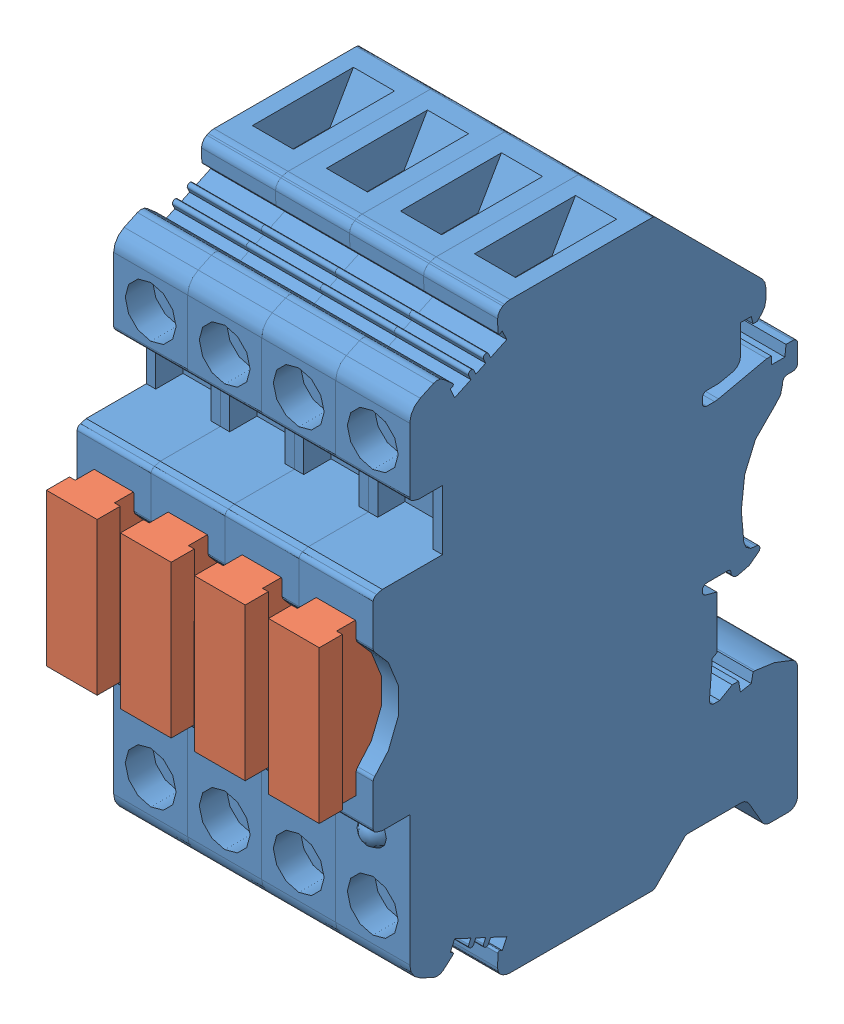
SolidWorks assembly UK6-fsi fused bank.SLDASM, configuration Default (file format 5000). Lengths in mm.
Overall size (32.62 64.21 51.36).
12 component instances, 2 part files, 9 mates.
Components (placement in the parent):
- UK6-fsi fused-1: UK6-fsi fused.SLDASM [Default] at (7.1145 4.2757 -6.6591) size (8.17 64.21 51.36)
  - 3118203_uk_6_fs-c_select-1: 3118203_uk_6_fs-c_select.sldprt [Default] at (-86.1178 45.6786 14.4098) size (8.17 64.21 46.74)
  - fusetop-1: fusetop.SLDPRT [Default] at (6.9864 27.5076 61.3042) x (-1 0.000226 0) z (0 0 -1) size (5.59 16.76 7.62)
- UK6-fsi fused-2: UK6-fsi fused.SLDASM [Default] at (-1.0355 4.2757 -6.6591) size (8.17 64.21 51.36)
  - 3118203_uk_6_fs-c_select-1: 3118203_uk_6_fs-c_select.sldprt [Default] at (-86.1178 45.6786 14.4098) size (8.17 64.21 46.74)
  - fusetop-1: fusetop.SLDPRT [Default] at (6.9864 27.5076 61.3042) x (-1 0.000226 0) z (0 0 -1) size (5.59 16.76 7.62)
- UK6-fsi fused-3: UK6-fsi fused.SLDASM [Default] at (15.2645 4.2757 -6.6591) size (8.17 64.21 51.36)
  - 3118203_uk_6_fs-c_select-1: 3118203_uk_6_fs-c_select.sldprt [Default] at (-86.1178 45.6786 14.4098) size (8.17 64.21 46.74)
  - fusetop-1: fusetop.SLDPRT [Default] at (6.9864 27.5076 61.3042) x (-1 0.000226 0) z (0 0 -1) size (5.59 16.76 7.62)
- UK6-fsi fused-4: UK6-fsi fused.SLDASM [Default] at (23.4145 4.2757 -6.6591) size (8.17 64.21 51.36)
  - 3118203_uk_6_fs-c_select-1: 3118203_uk_6_fs-c_select.sldprt [Default] at (-86.1178 45.6786 14.4098) size (8.17 64.21 46.74)
  - fusetop-1: fusetop.SLDPRT [Default] at (6.9864 27.5076 61.3042) x (-1 0.000226 0) z (0 0 -1) size (5.59 16.76 7.62)
Mates (geometry in assembly coordinates):
- Coincident1: coincident anti-aligned: plane of UK6-fsi fused-1/3118203_uk_6_fs-c_select-1 through (15.9379 72.5547 19.1514) normal (-1 0 0); plane of UK6-fsi fused-2/3118203_uk_6_fs-c_select-1 through (15.9379 8.3547 19.1514) normal (1 0 0)
- Coincident2: coincident: plane of UK6-fsi fused-1/3118203_uk_6_fs-c_select-1; plane of UK6-fsi fused-3/3118203_uk_6_fs-c_select-1
- Coincident3: coincident anti-aligned: plane of UK6-fsi fused-3/3118203_uk_6_fs-c_select-1; plane of UK6-fsi fused-4/3118203_uk_6_fs-c_select-1
- Coincident4: coincident aligned: plane of UK6-fsi fused-1/3118203_uk_6_fs-c_select-1 through (15.9379 14.6288 61.8545) normal (0 0 1); plane of UK6-fsi fused-2/3118203_uk_6_fs-c_select-1
- Coincident5: coincident aligned: plane of UK6-fsi fused-1/3118203_uk_6_fs-c_select-1; plane of UK6-fsi fused-3/3118203_uk_6_fs-c_select-1
- Coincident6: coincident aligned: plane of UK6-fsi fused-3/3118203_uk_6_fs-c_select-1; plane of UK6-fsi fused-4/3118203_uk_6_fs-c_select-1
- Coincident7: coincident aligned: plane of UK6-fsi fused-1/3118203_uk_6_fs-c_select-1 through (15.9379 11.8547 31.2478) normal (0 -1 0); plane of UK6-fsi fused-2/3118203_uk_6_fs-c_select-1
- Coincident8: coincident aligned: plane of UK6-fsi fused-1/3118203_uk_6_fs-c_select-1; plane of UK6-fsi fused-3/3118203_uk_6_fs-c_select-1
- Coincident9: coincident aligned: plane of UK6-fsi fused-3/3118203_uk_6_fs-c_select-1; plane of UK6-fsi fused-4/3118203_uk_6_fs-c_select-1
